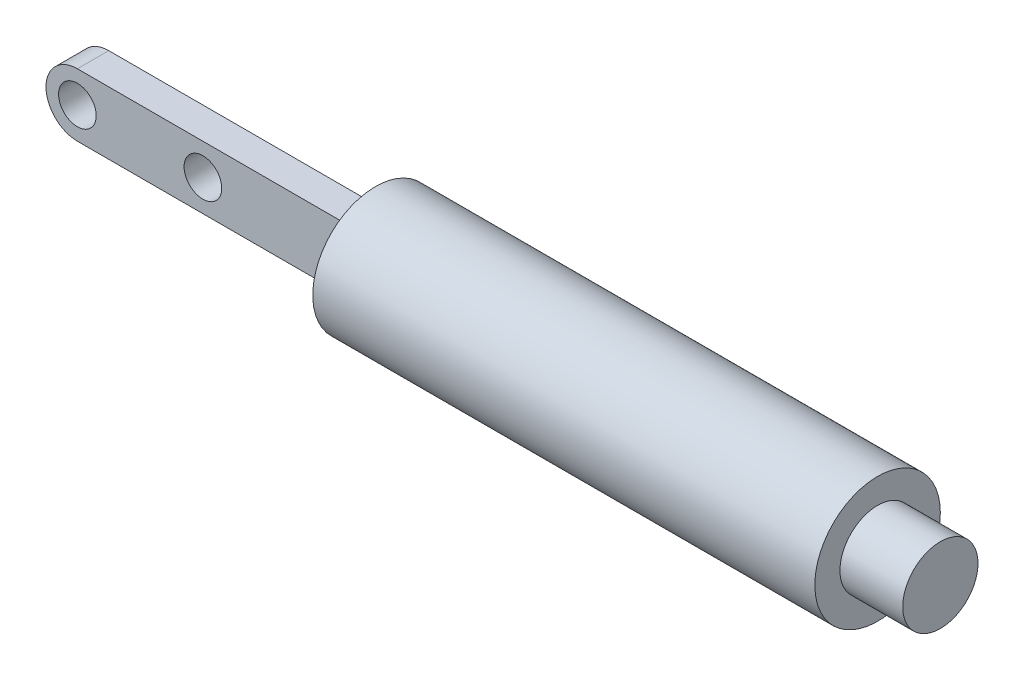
from build123d import *

# Parameters (mm, degrees)
SKETCH1_R           = 10
BOSS_EXTRUDE1_DEPTH = 40
SKETCH2_R           = 6
BOSS_EXTRUDE2_DEPTH = 10
SKETCH3_R           = 3
BOSS_EXTRUDE3_DEPTH = 2.5


with BuildPart() as part:
    # Sketch1 → Boss-Extrude1 (new, symmetric)
    with BuildSketch(Plane(origin=(0, 0, 0), x_dir=(0, 0, -1), z_dir=(1, 0, 0))):
        Circle(SKETCH1_R)
    extrude(amount=BOSS_EXTRUDE1_DEPTH, both=True)

    # Sketch2 → Boss-Extrude2 (add)
    with BuildSketch(Plane(origin=(40, 0, 0), x_dir=(0, 0, -1), z_dir=(1, 0, 0))):
        Circle(SKETCH2_R)
    extrude(amount=BOSS_EXTRUDE2_DEPTH)

    # Sketch3 → Boss-Extrude3 (add, symmetric)
    with BuildSketch(Plane.XY):
        with BuildLine():
            Line((-85, 5), (-40, 5))
            Line((-40, 5), (-40, -5))
            Line((-40, -5), (-85, -5))
            ThreePointArc((-85, -5), (-90, 0), (-85, 5))
        make_face()
        with Locations((-65, 0)):
            Circle(SKETCH3_R, mode=Mode.SUBTRACT)
        with Locations((-85, 0)):
            Circle(SKETCH3_R, mode=Mode.SUBTRACT)
    extrude(amount=BOSS_EXTRUDE3_DEPTH, both=True)


solid = part.part
